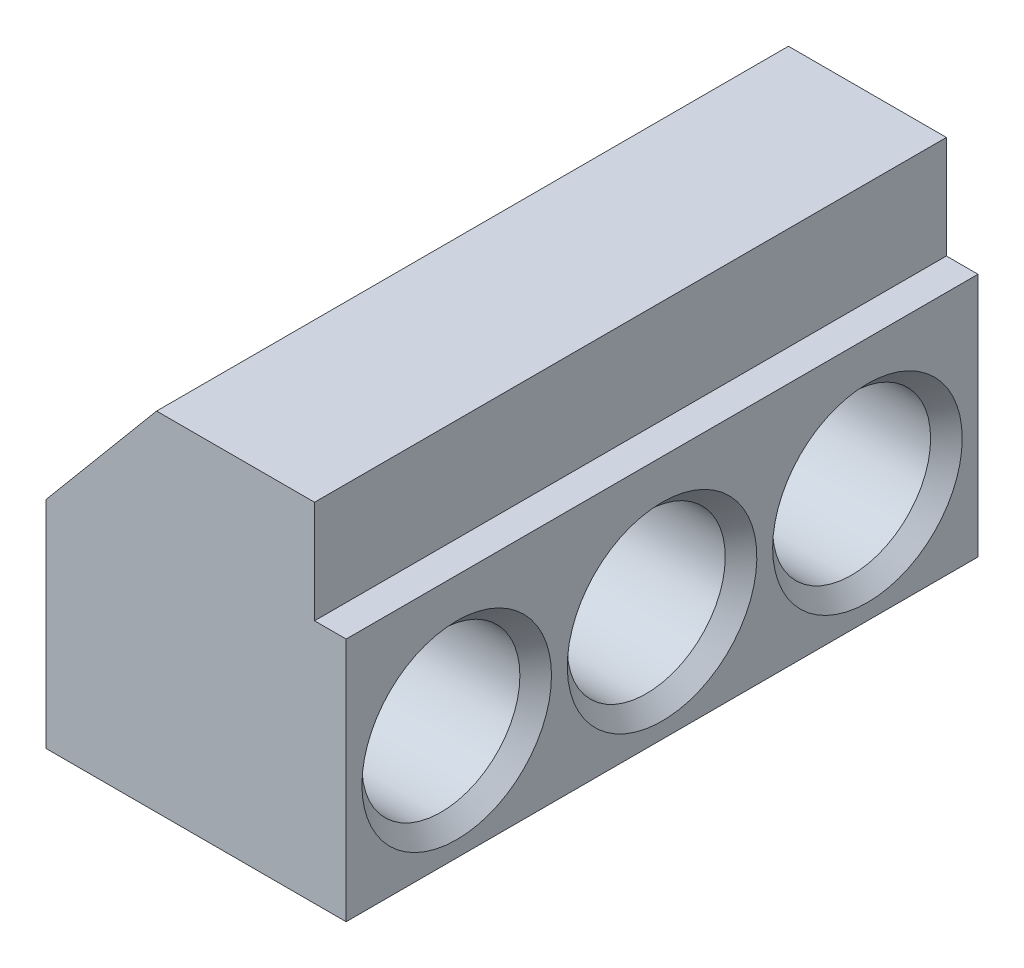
from build123d import *

# Parameters (mm, degrees)
BASE_EXTRUSION_DEPTH    = 40
ESQUISSE2_W             = 2
ESQUISSE2_H             = 6.5
ENL_V_MAT_EXTRU_1_DEPTH = 50.44694126
ESQUISSE3_R             = 5
ENL_V_MAT_EXTRU_2_DEPTH = 50.44694126
CHANFREIN1_SIZE         = 1
ESQUISSE5_R             = 5
ENL_V_MAT_EXTRU_3_DEPTH = 10
ESQUISSE6_R             = 3
ENL_V_MAT_EXTRU_4_DEPTH = 47.733285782
CHANFREIN2_SIZE         = 1
CHANFREIN3_SIZE         = 0.5


with BuildPart() as part:
    # Esquisse1 → Base-Extrusion (new body)
    with BuildSketch(Plane.XY):
        Polygon((0, 0), (19, 0), (19, 22), (7, 22), (0, 13.65), align=None)
    extrude(amount=-BASE_EXTRUSION_DEPTH)

    # Esquisse2 → Enl_v. mat.-Extru.1 (cut, through all)
    with BuildSketch(Plane.XY):
        with Locations((18, 18.75)):
            Rectangle(ESQUISSE2_W, ESQUISSE2_H)
    extrude(amount=-ENL_V_MAT_EXTRU_1_DEPTH, mode=Mode.SUBTRACT)

    # Esquisse3 → Enl_v. mat.-Extru.2 (cut, through all)
    with BuildSketch(Plane(origin=(19, 0, 0), x_dir=(0, 0, -1), z_dir=(1, 0, 0))):
        with Locations(Location((7, 7, 0), (0, 0, 90))):
            Circle(ESQUISSE3_R)
        with Locations(Location((33, 7, 0), (0, 0, 90))):
            Circle(ESQUISSE3_R)
    extrude(amount=-ENL_V_MAT_EXTRU_2_DEPTH, mode=Mode.SUBTRACT)

    # Chanfrein1
    chanfrein1_edges = [part.edges().sort_by_distance(p)[0] for p in [
        (0, 2, -7),
        (19, 2, -7),
        (0, 2, -33),
        (19, 2, -33),
    ]]
    chamfer(chanfrein1_edges, length=CHANFREIN1_SIZE)

    # Esquisse5 → Enl_v. mat.-Extru.3 (cut)
    with BuildSketch(Plane(origin=(19, 0, 0), x_dir=(0, 0, -1), z_dir=(1, 0, 0))):
        with Locations(Location((20, 7, 0), (0, 0, 90))):
            Circle(ESQUISSE5_R)
    extrude(amount=-ENL_V_MAT_EXTRU_3_DEPTH, mode=Mode.SUBTRACT)

    # Esquisse6 → Enl_v. mat.-Extru.4 (cut, through all)
    with BuildSketch(Plane(origin=(9, 0, 0), x_dir=(0, 0, -1), z_dir=(1, 0, 0))):
        with Locations(Location((20, 7, 0), (0, 0, 90))):
            Circle(ESQUISSE6_R)
    extrude(amount=-ENL_V_MAT_EXTRU_4_DEPTH, mode=Mode.SUBTRACT)

    # Chanfrein2
    chanfrein2_edges = [part.edges().sort_by_distance(p)[0] for p in [
        (19, 2, -20),
    ]]
    chamfer(chanfrein2_edges, length=CHANFREIN2_SIZE)

    # Chanfrein3
    chanfrein3_edges = [part.edges().sort_by_distance(p)[0] for p in [
        (0, 4, -20),
    ]]
    chamfer(chanfrein3_edges, length=CHANFREIN3_SIZE)


solid = part.part
